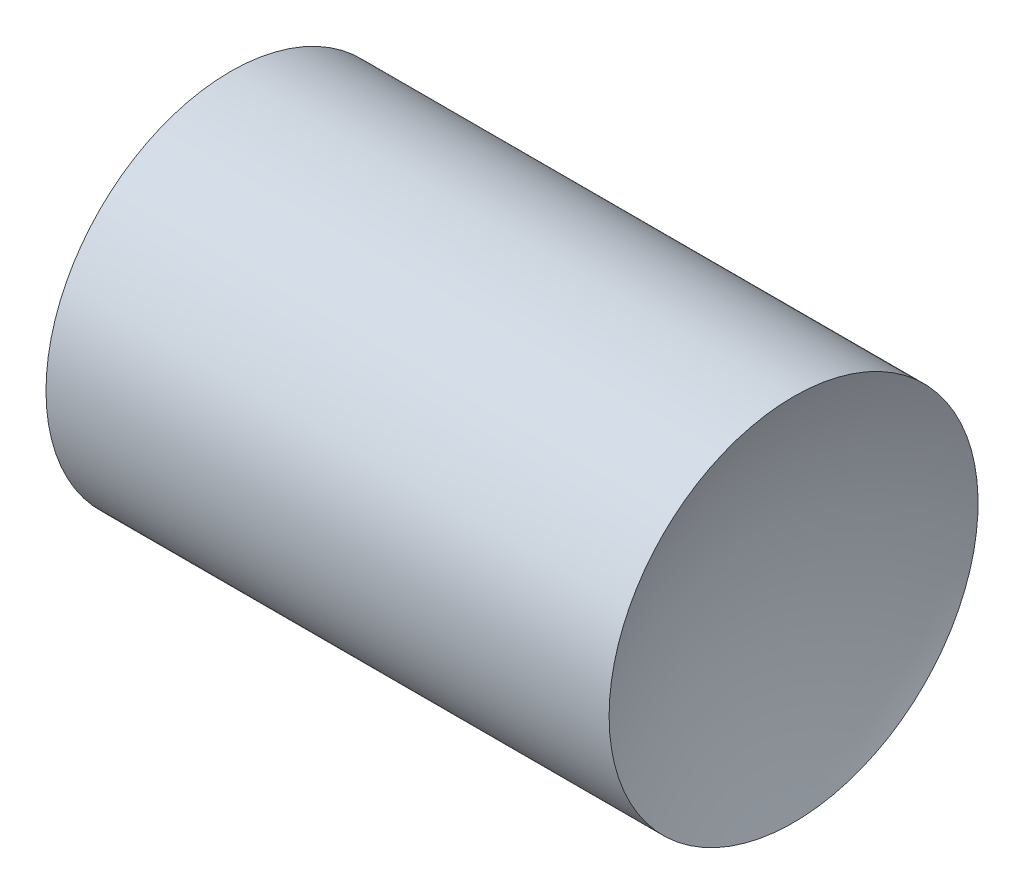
ISO-10303-21;
HEADER;
FILE_DESCRIPTION(('STEP AP214'),'2;1');
FILE_NAME('part.step','',(''),(''),'','','');
FILE_SCHEMA(('AUTOMOTIVE_DESIGN { 1 0 10303 214 1 1 1 1 }'));
ENDSEC;
DATA;
#1=APPLICATION_CONTEXT('core data for automotive mechanical design processes');
#2=APPLICATION_PROTOCOL_DEFINITION('international standard','automotive_design',2000,#1);
#3=PRODUCT_CONTEXT('',#1,'mechanical');
#4=PRODUCT('Part','Part','',(#3));
#5=PRODUCT_RELATED_PRODUCT_CATEGORY('part','',(#4));
#6=PRODUCT_DEFINITION_FORMATION('','',#4);
#7=PRODUCT_DEFINITION_CONTEXT('part definition',#1,'design');
#8=PRODUCT_DEFINITION('design','',#6,#7);
#9=PRODUCT_DEFINITION_SHAPE('','',#8);
#10=(LENGTH_UNIT() NAMED_UNIT(*) SI_UNIT(.MILLI.,.METRE.));
#11=(NAMED_UNIT(*) PLANE_ANGLE_UNIT() SI_UNIT($,.RADIAN.));
#12=(NAMED_UNIT(*) SI_UNIT($,.STERADIAN.) SOLID_ANGLE_UNIT());
#13=UNCERTAINTY_MEASURE_WITH_UNIT(LENGTH_MEASURE(1.E-05),#10,'distance_accuracy_value','');
#14=(GEOMETRIC_REPRESENTATION_CONTEXT(3) GLOBAL_UNCERTAINTY_ASSIGNED_CONTEXT((#13)) GLOBAL_UNIT_ASSIGNED_CONTEXT((#10,
#11,#12)) REPRESENTATION_CONTEXT('',''));
#15=CARTESIAN_POINT('',(0.,0.,0.));
#16=DIRECTION('',(0.,0.,1.));
#17=DIRECTION('',(1.,0.,0.));
#18=AXIS2_PLACEMENT_3D('',#15,#16,#17);
#19=CARTESIAN_POINT('',(23.42,0.,8.));
#20=DIRECTION('',(-1.,0.,0.));
#21=DIRECTION('',(0.,1.,0.));
#22=AXIS2_PLACEMENT_3D('',#19,#20,#21);
#23=SPHERICAL_SURFACE('',#22,11.94);
#24=CARTESIAN_POINT('',(11.7446584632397,0.,8.));
#25=DIRECTION('',(-1.,0.,0.));
#26=DIRECTION('',(0.,0.,1.));
#27=AXIS2_PLACEMENT_3D('',#24,#25,#26);
#28=CIRCLE('',#27,2.5);
#29=CARTESIAN_POINT('',(11.7446584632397,0.,10.5));
#30=VERTEX_POINT('',#29);
#31=EDGE_CURVE('E36',#30,#30,#28,.T.);
#32=ORIENTED_EDGE('',*,*,#31,.T.);
#33=EDGE_LOOP('',(#32));
#34=FACE_BOUND('',#33,.T.);
#35=ADVANCED_FACE('F30',(#34),#23,.T.);
#36=CARTESIAN_POINT('',(24.8875,0.,8.));
#37=DIRECTION('',(-1.,0.,0.));
#38=DIRECTION('',(0.,1.,0.));
#39=AXIS2_PLACEMENT_3D('',#36,#37,#38);
#40=SPHERICAL_SURFACE('',#39,6.0525);
#41=CARTESIAN_POINT('',(19.3754444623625,0.,8.));
#42=DIRECTION('',(-1.,0.,0.));
#43=DIRECTION('',(0.,0.,1.));
#44=AXIS2_PLACEMENT_3D('',#41,#42,#43);
#45=CIRCLE('',#44,2.5);
#46=CARTESIAN_POINT('',(19.3754444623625,0.,10.5));
#47=VERTEX_POINT('',#46);
#48=EDGE_CURVE('E10',#47,#47,#45,.T.);
#49=ORIENTED_EDGE('',*,*,#48,.F.);
#50=EDGE_LOOP('',(#49));
#51=FACE_BOUND('',#50,.T.);
#52=ADVANCED_FACE('F45',(#51),#40,.F.);
#53=CARTESIAN_POINT('',(0.,0.,8.));
#54=DIRECTION('',(-1.,0.,0.));
#55=DIRECTION('',(0.,0.,1.));
#56=AXIS2_PLACEMENT_3D('',#53,#54,#55);
#57=CYLINDRICAL_SURFACE('',#56,2.5);
#58=ORIENTED_EDGE('',*,*,#31,.F.);
#59=EDGE_LOOP('',(#58));
#60=FACE_BOUND('',#59,.T.);
#61=ORIENTED_EDGE('',*,*,#48,.T.);
#62=EDGE_LOOP('',(#61));
#63=FACE_BOUND('',#62,.T.);
#64=ADVANCED_FACE('F43',(#60,#63),#57,.T.);
#65=CLOSED_SHELL('',(#35,#52,#64));
#66=MANIFOLD_SOLID_BREP('B2',#65);
#67=ADVANCED_BREP_SHAPE_REPRESENTATION('',(#18,#66),#14);
#68=SHAPE_DEFINITION_REPRESENTATION(#9,#67);
ENDSEC;
END-ISO-10303-21;
